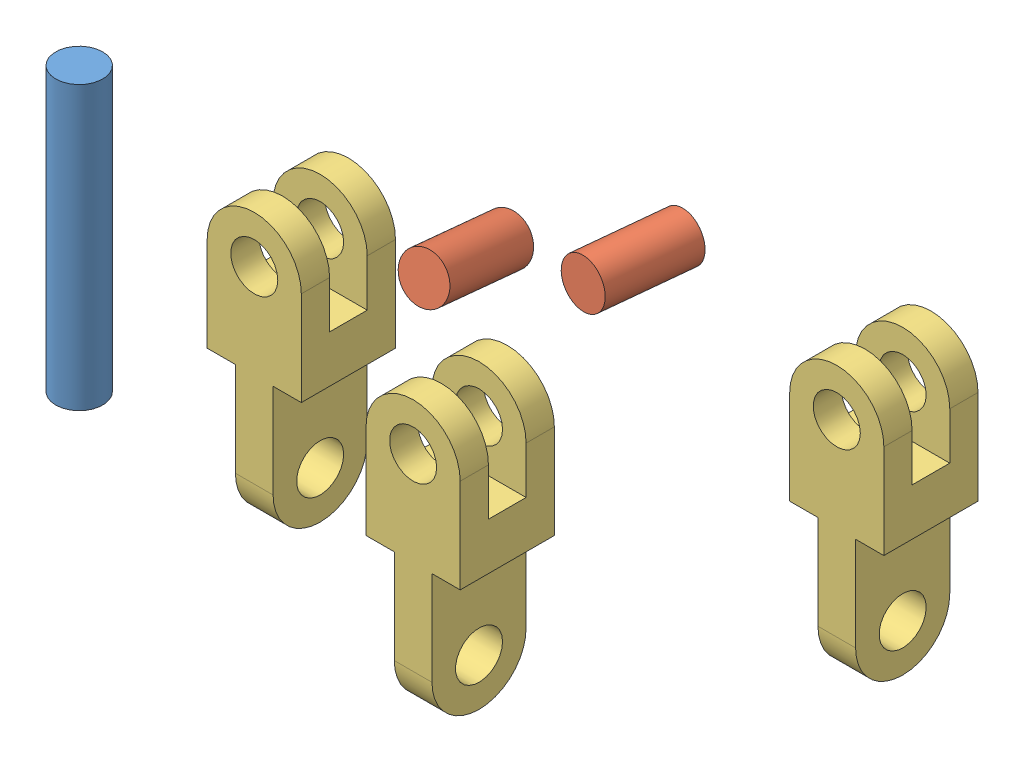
SolidWorks assembly CSW_tut_02.SLDASM, configuration Default (file format 13000). Lengths in mm.
Overall size (677.94 403.89 327.91).
6 component instances, 3 part files, 0 mates.
Components (placement in the parent):
- 2.13.1-1: 2.13.1.SLDPRT [Default] at origin size (50 300 50)
- 2.13.3-1: 2.13.3.SLDPRT [Default] at (264.9074 -113.8089 -101.3612) x (0.870112 -0.492787 0.008101) z (-0.484313 -0.851873 0.199382) size (50 100 50)
- 2.13.2-1: 2.13.2.SLDPRT [Default] at (164.889 -213.2033 -71.0064) size (100 300 100)
- 2.13.3-2: 2.13.3.SLDPRT [Default] at (373.4582 -94.7303 -161.8401) x (0.990951 -0.116472 0.066717) z (-0.118499 -0.99258 0.027267) size (50 100 50)
- 2.13.2-2: 2.13.2.SLDPRT [Default] at (602.9365 -225.2306 -251.6664) size (100 300 100)
- 2.13.2-3: 2.13.2.SLDPRT [Default] at (380.8716 -253.8889 -23.7582) size (100 300 100)
